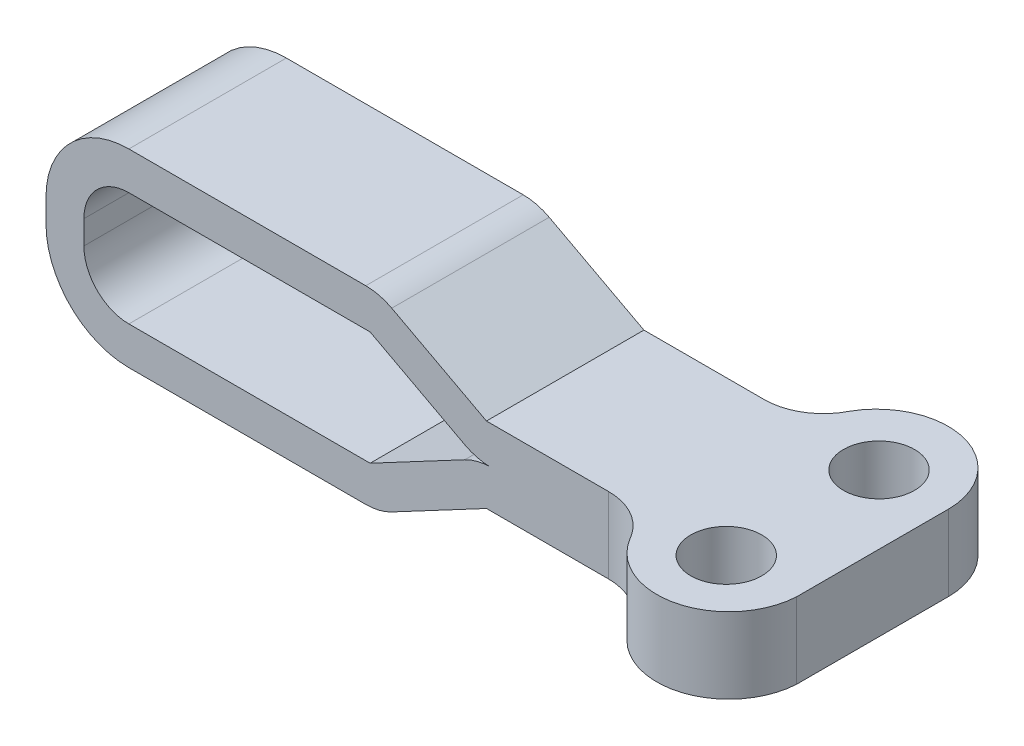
ISO-10303-21;
HEADER;
FILE_DESCRIPTION(('STEP AP214'),'2;1');
FILE_NAME('part.step','',(''),(''),'','','');
FILE_SCHEMA(('AUTOMOTIVE_DESIGN { 1 0 10303 214 1 1 1 1 }'));
ENDSEC;
DATA;
#1=APPLICATION_CONTEXT('core data for automotive mechanical design processes');
#2=APPLICATION_PROTOCOL_DEFINITION('international standard','automotive_design',2000,#1);
#3=PRODUCT_CONTEXT('',#1,'mechanical');
#4=PRODUCT('Part','Part','',(#3));
#5=PRODUCT_RELATED_PRODUCT_CATEGORY('part','',(#4));
#6=PRODUCT_DEFINITION_FORMATION('','',#4);
#7=PRODUCT_DEFINITION_CONTEXT('part definition',#1,'design');
#8=PRODUCT_DEFINITION('design','',#6,#7);
#9=PRODUCT_DEFINITION_SHAPE('','',#8);
#10=(LENGTH_UNIT() NAMED_UNIT(*) SI_UNIT(.MILLI.,.METRE.));
#11=(NAMED_UNIT(*) PLANE_ANGLE_UNIT() SI_UNIT($,.RADIAN.));
#12=(NAMED_UNIT(*) SI_UNIT($,.STERADIAN.) SOLID_ANGLE_UNIT());
#13=UNCERTAINTY_MEASURE_WITH_UNIT(LENGTH_MEASURE(1.E-05),#10,'distance_accuracy_value','');
#14=(GEOMETRIC_REPRESENTATION_CONTEXT(3) GLOBAL_UNCERTAINTY_ASSIGNED_CONTEXT((#13)) GLOBAL_UNIT_ASSIGNED_CONTEXT((#10,
#11,#12)) REPRESENTATION_CONTEXT('',''));
#15=CARTESIAN_POINT('',(0.,0.,0.));
#16=DIRECTION('',(0.,0.,1.));
#17=DIRECTION('',(1.,0.,0.));
#18=AXIS2_PLACEMENT_3D('',#15,#16,#17);
#19=CARTESIAN_POINT('',(-17.6259984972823,0.,-5.43724678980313));
#20=DIRECTION('',(0.,-1.,0.));
#21=DIRECTION('',(-1.00000000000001,0.,0.));
#22=AXIS2_PLACEMENT_3D('',#19,#20,#21);
#23=CYLINDRICAL_SURFACE('',#22,2.5);
#24=DIRECTION('',(0.,-1.,0.));
#25=VECTOR('',#24,1.);
#26=CARTESIAN_POINT('',(-15.4352933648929,0.,-6.64174295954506));
#27=LINE('',#26,#25);
#28=CARTESIAN_POINT('',(-15.4352933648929,1.6,-6.64174295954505));
#29=VERTEX_POINT('',#28);
#30=CARTESIAN_POINT('',(-15.4352933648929,-1.6,-6.64174295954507));
#31=VERTEX_POINT('',#30);
#32=EDGE_CURVE('E515',#29,#31,#27,.T.);
#33=ORIENTED_EDGE('',*,*,#32,.F.);
#34=CARTESIAN_POINT('',(-17.6259984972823,1.6,-5.43724678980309));
#35=DIRECTION('',(0.,-1.,0.));
#36=DIRECTION('',(-1.00000000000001,0.,0.));
#37=AXIS2_PLACEMENT_3D('',#34,#35,#36);
#38=CIRCLE('',#37,2.5);
#39=CARTESIAN_POINT('',(-17.6259984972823,1.6,-7.93724678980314));
#40=VERTEX_POINT('',#39);
#41=EDGE_CURVE('E356',#29,#40,#38,.F.);
#42=ORIENTED_EDGE('',*,*,#41,.T.);
#43=DIRECTION('',(0.,1.,0.));
#44=VECTOR('',#43,1.);
#45=CARTESIAN_POINT('',(-17.6259984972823,0.,-7.93724678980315));
#46=LINE('',#45,#44);
#47=CARTESIAN_POINT('',(-17.6259984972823,-1.6,-7.93724678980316));
#48=VERTEX_POINT('',#47);
#49=EDGE_CURVE('E379',#48,#40,#46,.T.);
#50=ORIENTED_EDGE('',*,*,#49,.F.);
#51=CARTESIAN_POINT('',(-17.6259984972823,-1.6,-5.43724678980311));
#52=DIRECTION('',(0.,-1.,0.));
#53=DIRECTION('',(-1.00000000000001,0.,0.));
#54=AXIS2_PLACEMENT_3D('',#51,#52,#53);
#55=CIRCLE('',#54,2.5);
#56=EDGE_CURVE('E264',#31,#48,#55,.F.);
#57=ORIENTED_EDGE('',*,*,#56,.F.);
#58=EDGE_LOOP('',(#33,#42,#50,#57));
#59=FACE_BOUND('',#58,.T.);
#60=ADVANCED_FACE('F17',(#59),#23,.F.);
#61=CARTESIAN_POINT('',(-41.3856749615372,-30.3883414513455,-8.08724678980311));
#62=DIRECTION('',(-1.00000000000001,0.,0.));
#63=DIRECTION('',(0.,1.,0.));
#64=AXIS2_PLACEMENT_3D('',#61,#62,#63);
#65=PLANE('',#64);
#66=DIRECTION('',(0.,0.,1.00000000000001));
#67=VECTOR('',#66,1.);
#68=CARTESIAN_POINT('',(-41.3856749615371,-0.5,-19.3102188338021));
#69=LINE('',#68,#67);
#70=CARTESIAN_POINT('',(-41.385674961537,-0.500000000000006,-7.93724678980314));
#71=VERTEX_POINT('',#70);
#72=CARTESIAN_POINT('',(-41.3856749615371,-0.499999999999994,-14.5872467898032));
#73=VERTEX_POINT('',#72);
#74=EDGE_CURVE('E195',#71,#73,#69,.F.);
#75=ORIENTED_EDGE('',*,*,#74,.F.);
#76=DIRECTION('',(0.,1.,0.));
#77=VECTOR('',#76,1.);
#78=CARTESIAN_POINT('',(-41.3856749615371,-25.5685929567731,-7.93724678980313));
#79=LINE('',#78,#77);
#80=CARTESIAN_POINT('',(-41.3856749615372,0.499999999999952,-7.93724678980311));
#81=VERTEX_POINT('',#80);
#82=EDGE_CURVE('E234',#81,#71,#79,.F.);
#83=ORIENTED_EDGE('',*,*,#82,.F.);
#84=DIRECTION('',(0.,0.,1.00000000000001));
#85=VECTOR('',#84,1.);
#86=CARTESIAN_POINT('',(-41.3856749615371,0.499999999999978,-19.3102188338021));
#87=LINE('',#86,#85);
#88=CARTESIAN_POINT('',(-41.3856749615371,0.499999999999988,-14.5872467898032));
#89=VERTEX_POINT('',#88);
#90=EDGE_CURVE('E338',#89,#81,#87,.T.);
#91=ORIENTED_EDGE('',*,*,#90,.F.);
#92=DIRECTION('',(0.,-1.,0.));
#93=VECTOR('',#92,1.);
#94=CARTESIAN_POINT('',(-41.3856749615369,-0.558341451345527,-14.5872467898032));
#95=LINE('',#94,#93);
#96=EDGE_CURVE('E247',#73,#89,#95,.F.);
#97=ORIENTED_EDGE('',*,*,#96,.F.);
#98=EDGE_LOOP('',(#75,#83,#91,#97));
#99=FACE_BOUND('',#98,.T.);
#100=ADVANCED_FACE('F442',(#99),#65,.T.);
#101=CARTESIAN_POINT('',(-37.885674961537,-0.5,-19.3102188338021));
#102=DIRECTION('',(0.,0.,1.00000000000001));
#103=DIRECTION('',(0.,1.,0.));
#104=AXIS2_PLACEMENT_3D('',#101,#102,#103);
#105=CYLINDRICAL_SURFACE('',#104,3.5);
#106=CARTESIAN_POINT('',(-37.885674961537,-0.500000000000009,-7.93724678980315));
#107=DIRECTION('',(0.,0.,1.00000000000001));
#108=DIRECTION('',(0.,1.,0.));
#109=AXIS2_PLACEMENT_3D('',#106,#107,#108);
#110=CIRCLE('',#109,3.5);
#111=CARTESIAN_POINT('',(-37.885674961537,-4.,-7.93724678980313));
#112=VERTEX_POINT('',#111);
#113=EDGE_CURVE('E233',#112,#71,#110,.F.);
#114=ORIENTED_EDGE('',*,*,#113,.T.);
#115=ORIENTED_EDGE('',*,*,#74,.T.);
#116=CARTESIAN_POINT('',(-37.885674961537,-0.500000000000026,-14.5872467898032));
#117=DIRECTION('',(0.,0.,1.00000000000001));
#118=DIRECTION('',(0.,1.,0.));
#119=AXIS2_PLACEMENT_3D('',#116,#117,#118);
#120=CIRCLE('',#119,3.5);
#121=CARTESIAN_POINT('',(-37.885674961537,-4.,-14.5872467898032));
#122=VERTEX_POINT('',#121);
#123=EDGE_CURVE('E226',#73,#122,#120,.T.);
#124=ORIENTED_EDGE('',*,*,#123,.T.);
#125=DIRECTION('',(0.,0.,1.00000000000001));
#126=VECTOR('',#125,1.);
#127=CARTESIAN_POINT('',(-37.885674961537,-4.,-8.08724678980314));
#128=LINE('',#127,#126);
#129=EDGE_CURVE('E221',#112,#122,#128,.F.);
#130=ORIENTED_EDGE('',*,*,#129,.F.);
#131=EDGE_LOOP('',(#114,#115,#124,#130));
#132=FACE_BOUND('',#131,.T.);
#133=ADVANCED_FACE('F464',(#132),#105,.T.);
#134=CARTESIAN_POINT('',(-12.2384835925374,-4.,-8.08724678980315));
#135=DIRECTION('',(0.,-1.,0.));
#136=DIRECTION('',(0.,0.,1.00000000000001));
#137=AXIS2_PLACEMENT_3D('',#134,#135,#136);
#138=PLANE('',#137);
#139=DIRECTION('',(-1.00000000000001,0.,0.));
#140=VECTOR('',#139,1.);
#141=CARTESIAN_POINT('',(-12.2384835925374,-4.,-14.5872467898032));
#142=LINE('',#141,#140);
#143=CARTESIAN_POINT('',(-27.8807661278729,-4.,-14.5872467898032));
#144=VERTEX_POINT('',#143);
#145=EDGE_CURVE('E204',#122,#144,#142,.F.);
#146=ORIENTED_EDGE('',*,*,#145,.T.);
#147=DIRECTION('',(0.,0.,1.00000000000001));
#148=VECTOR('',#147,1.);
#149=CARTESIAN_POINT('',(-27.8807661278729,-4.,-18.2863858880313));
#150=LINE('',#149,#148);
#151=CARTESIAN_POINT('',(-27.8807661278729,-4.,-7.93724678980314));
#152=VERTEX_POINT('',#151);
#153=EDGE_CURVE('E209',#152,#144,#150,.F.);
#154=ORIENTED_EDGE('',*,*,#153,.F.);
#155=DIRECTION('',(-1.00000000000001,0.,0.));
#156=VECTOR('',#155,1.);
#157=CARTESIAN_POINT('',(-12.2384835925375,-4.,-7.93724678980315));
#158=LINE('',#157,#156);
#159=EDGE_CURVE('E194',#152,#112,#158,.T.);
#160=ORIENTED_EDGE('',*,*,#159,.T.);
#161=ORIENTED_EDGE('',*,*,#129,.T.);
#162=EDGE_LOOP('',(#146,#154,#160,#161));
#163=FACE_BOUND('',#162,.T.);
#164=ADVANCED_FACE('F458',(#163),#138,.T.);
#165=CARTESIAN_POINT('',(-27.8807661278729,-1.6634,-18.2863858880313));
#166=DIRECTION('',(0.,0.,1.00000000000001));
#167=DIRECTION('',(0.,1.,0.));
#168=AXIS2_PLACEMENT_3D('',#165,#166,#167);
#169=CYLINDRICAL_SURFACE('',#168,2.3366);
#170=CARTESIAN_POINT('',(-27.8807661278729,-1.6634,-7.93724678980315));
#171=DIRECTION('',(0.,0.,1.00000000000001));
#172=DIRECTION('',(0.,1.,0.));
#173=AXIS2_PLACEMENT_3D('',#170,#171,#172);
#174=CIRCLE('',#173,2.3366);
#175=CARTESIAN_POINT('',(-26.7837988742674,-3.72649534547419,-7.93724678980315));
#176=VERTEX_POINT('',#175);
#177=EDGE_CURVE('E214',#176,#152,#174,.F.);
#178=ORIENTED_EDGE('',*,*,#177,.T.);
#179=ORIENTED_EDGE('',*,*,#153,.T.);
#180=CARTESIAN_POINT('',(-27.8807661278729,-1.6634,-14.5872467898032));
#181=DIRECTION('',(0.,0.,1.00000000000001));
#182=DIRECTION('',(0.,1.,0.));
#183=AXIS2_PLACEMENT_3D('',#180,#181,#182);
#184=CIRCLE('',#183,2.3366);
#185=CARTESIAN_POINT('',(-26.7837988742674,-3.72649534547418,-14.5872467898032));
#186=VERTEX_POINT('',#185);
#187=EDGE_CURVE('E281',#144,#186,#184,.T.);
#188=ORIENTED_EDGE('',*,*,#187,.T.);
#189=DIRECTION('',(0.,0.,-1.00000000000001));
#190=VECTOR('',#189,1.);
#191=CARTESIAN_POINT('',(-26.7837988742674,-3.72649534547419,-8.08724678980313));
#192=LINE('',#191,#190);
#193=EDGE_CURVE('E493',#176,#186,#192,.T.);
#194=ORIENTED_EDGE('',*,*,#193,.F.);
#195=EDGE_LOOP('',(#178,#179,#188,#194));
#196=FACE_BOUND('',#195,.T.);
#197=ADVANCED_FACE('F452',(#196),#169,.T.);
#198=CARTESIAN_POINT('',(-13.6355100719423,3.26457382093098,-8.08724678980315));
#199=DIRECTION('',(0.469471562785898,-0.882947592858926,0.));
#200=DIRECTION('',(-0.882947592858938,-0.469471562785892,0.));
#201=AXIS2_PLACEMENT_3D('',#198,#199,#200);
#202=PLANE('',#201);
#203=DIRECTION('',(-0.882947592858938,-0.469471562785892,0.));
#204=VECTOR('',#203,1.);
#205=CARTESIAN_POINT('',(-13.6355100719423,3.26457382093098,-14.5872467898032));
#206=LINE('',#205,#204);
#207=CARTESIAN_POINT('',(-22.784442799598,-1.6,-14.5872467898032));
#208=VERTEX_POINT('',#207);
#209=EDGE_CURVE('E275',#186,#208,#206,.F.);
#210=ORIENTED_EDGE('',*,*,#209,.T.);
#211=DIRECTION('',(0.,0.,1.));
#212=VECTOR('',#211,1.);
#213=CARTESIAN_POINT('',(-22.784442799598,-1.6,-8.08724678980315));
#214=LINE('',#213,#212);
#215=CARTESIAN_POINT('',(-22.784442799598,-1.6,-7.93724678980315));
#216=VERTEX_POINT('',#215);
#217=EDGE_CURVE('E376',#208,#216,#214,.T.);
#218=ORIENTED_EDGE('',*,*,#217,.T.);
#219=DIRECTION('',(-0.882947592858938,-0.469471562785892,0.));
#220=VECTOR('',#219,1.);
#221=CARTESIAN_POINT('',(-13.6355100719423,3.26457382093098,-7.93724678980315));
#222=LINE('',#221,#220);
#223=EDGE_CURVE('E278',#216,#176,#222,.T.);
#224=ORIENTED_EDGE('',*,*,#223,.T.);
#225=ORIENTED_EDGE('',*,*,#193,.T.);
#226=EDGE_LOOP('',(#210,#218,#224,#225));
#227=FACE_BOUND('',#226,.T.);
#228=ADVANCED_FACE('F449',(#227),#202,.T.);
#229=CARTESIAN_POINT('',(-22.6007877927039,-2.3366,-18.1431179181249));
#230=DIRECTION('',(0.,0.,1.00000000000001));
#231=DIRECTION('',(-1.00000000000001,0.,0.));
#232=AXIS2_PLACEMENT_3D('',#229,#230,#231);
#233=CYLINDRICAL_SURFACE('',#232,2.3366);
#234=CARTESIAN_POINT('',(-22.6007877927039,-2.3366,-7.93724678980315));
#235=DIRECTION('',(0.,0.,1.00000000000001));
#236=DIRECTION('',(-1.00000000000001,0.,0.));
#237=AXIS2_PLACEMENT_3D('',#234,#235,#236);
#238=CIRCLE('',#237,2.3366);
#239=CARTESIAN_POINT('',(-22.6007877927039,0.,-7.93724678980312));
#240=VERTEX_POINT('',#239);
#241=CARTESIAN_POINT('',(-23.6977550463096,-0.273504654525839,-7.93724678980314));
#242=VERTEX_POINT('',#241);
#243=EDGE_CURVE('E211',#240,#242,#238,.T.);
#244=ORIENTED_EDGE('',*,*,#243,.F.);
#245=DIRECTION('',(0.,0.,-1.00000000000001));
#246=VECTOR('',#245,1.);
#247=CARTESIAN_POINT('',(-22.6007877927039,0.,-8.08724678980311));
#248=LINE('',#247,#246);
#249=CARTESIAN_POINT('',(-22.6007877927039,0.,-14.5872467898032));
#250=VERTEX_POINT('',#249);
#251=EDGE_CURVE('E274',#240,#250,#248,.T.);
#252=ORIENTED_EDGE('',*,*,#251,.T.);
#253=CARTESIAN_POINT('',(-22.6007877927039,-2.3366,-14.5872467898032));
#254=DIRECTION('',(0.,0.,1.00000000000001));
#255=DIRECTION('',(-1.00000000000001,0.,0.));
#256=AXIS2_PLACEMENT_3D('',#253,#254,#255);
#257=CIRCLE('',#256,2.3366);
#258=CARTESIAN_POINT('',(-23.6977550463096,-0.273504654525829,-14.5872467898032));
#259=VERTEX_POINT('',#258);
#260=EDGE_CURVE('E272',#259,#250,#257,.F.);
#261=ORIENTED_EDGE('',*,*,#260,.F.);
#262=DIRECTION('',(0.,0.,1.00000000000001));
#263=VECTOR('',#262,1.);
#264=CARTESIAN_POINT('',(-23.6977550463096,-0.273504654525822,-18.1431179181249));
#265=LINE('',#264,#263);
#266=EDGE_CURVE('E208',#259,#242,#265,.T.);
#267=ORIENTED_EDGE('',*,*,#266,.T.);
#268=EDGE_LOOP('',(#244,#252,#261,#267));
#269=FACE_BOUND('',#268,.T.);
#270=ADVANCED_FACE('F401',(#269),#233,.T.);
#271=CARTESIAN_POINT('',(-14.3866645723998,4.67728996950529,-8.0872467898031));
#272=DIRECTION('',(0.469471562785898,-0.882947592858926,0.));
#273=DIRECTION('',(-0.882947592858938,-0.469471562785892,0.));
#274=AXIS2_PLACEMENT_3D('',#271,#272,#273);
#275=PLANE('',#274);
#276=DIRECTION('',(-0.882947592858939,-0.469471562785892,0.));
#277=VECTOR('',#276,1.);
#278=CARTESIAN_POINT('',(-23.6977550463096,-0.273504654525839,-7.93724678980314));
#279=LINE('',#278,#277);
#280=CARTESIAN_POINT('',(-27.6971111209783,-2.4,-7.93724678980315));
#281=VERTEX_POINT('',#280);
#282=EDGE_CURVE('E203',#242,#281,#279,.T.);
#283=ORIENTED_EDGE('',*,*,#282,.F.);
#284=ORIENTED_EDGE('',*,*,#266,.F.);
#285=DIRECTION('',(0.882947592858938,0.469471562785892,0.));
#286=VECTOR('',#285,1.);
#287=CARTESIAN_POINT('',(-27.5349533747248,-2.3137791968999,-14.5872467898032));
#288=LINE('',#287,#286);
#289=CARTESIAN_POINT('',(-27.6971111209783,-2.4,-14.5872467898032));
#290=VERTEX_POINT('',#289);
#291=EDGE_CURVE('E188',#290,#259,#288,.T.);
#292=ORIENTED_EDGE('',*,*,#291,.F.);
#293=DIRECTION('',(0.,0.,-1.));
#294=VECTOR('',#293,1.);
#295=CARTESIAN_POINT('',(-27.6971111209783,-2.4,-8.0872467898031));
#296=LINE('',#295,#294);
#297=EDGE_CURVE('E21',#281,#290,#296,.T.);
#298=ORIENTED_EDGE('',*,*,#297,.F.);
#299=EDGE_LOOP('',(#283,#284,#292,#298));
#300=FACE_BOUND('',#299,.T.);
#301=ADVANCED_FACE('F206',(#300),#275,.F.);
#302=CARTESIAN_POINT('',(-12.2384835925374,-2.4,-8.08724678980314));
#303=DIRECTION('',(0.,-1.,0.));
#304=DIRECTION('',(0.,0.,1.00000000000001));
#305=AXIS2_PLACEMENT_3D('',#302,#303,#304);
#306=PLANE('',#305);
#307=DIRECTION('',(-1.00000000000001,0.,0.));
#308=VECTOR('',#307,1.);
#309=CARTESIAN_POINT('',(-17.0582320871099,-2.4,-7.93724678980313));
#310=LINE('',#309,#308);
#311=CARTESIAN_POINT('',(-37.8856749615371,-2.4,-7.93724678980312));
#312=VERTEX_POINT('',#311);
#313=EDGE_CURVE('E201',#281,#312,#310,.T.);
#314=ORIENTED_EDGE('',*,*,#313,.F.);
#315=ORIENTED_EDGE('',*,*,#297,.T.);
#316=DIRECTION('',(-1.00000000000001,0.,0.));
#317=VECTOR('',#316,1.);
#318=CARTESIAN_POINT('',(-42.0684835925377,-2.4,-14.5872467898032));
#319=LINE('',#318,#317);
#320=CARTESIAN_POINT('',(-37.885674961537,-2.40000000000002,-14.5872467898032));
#321=VERTEX_POINT('',#320);
#322=EDGE_CURVE('E182',#321,#290,#319,.F.);
#323=ORIENTED_EDGE('',*,*,#322,.F.);
#324=DIRECTION('',(0.,0.,1.00000000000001));
#325=VECTOR('',#324,1.);
#326=CARTESIAN_POINT('',(-37.8856749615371,-2.4,-8.08724678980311));
#327=LINE('',#326,#325);
#328=EDGE_CURVE('E227',#312,#321,#327,.F.);
#329=ORIENTED_EDGE('',*,*,#328,.F.);
#330=EDGE_LOOP('',(#314,#315,#323,#329));
#331=FACE_BOUND('',#330,.T.);
#332=ADVANCED_FACE('F199',(#331),#306,.F.);
#333=CARTESIAN_POINT('',(-37.885674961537,-0.5,-19.3102188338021));
#334=DIRECTION('',(0.,0.,1.00000000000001));
#335=DIRECTION('',(0.,1.,0.));
#336=AXIS2_PLACEMENT_3D('',#333,#334,#335);
#337=CYLINDRICAL_SURFACE('',#336,1.9);
#338=DIRECTION('',(0.,0.,1.00000000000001));
#339=VECTOR('',#338,1.);
#340=CARTESIAN_POINT('',(-39.785674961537,-0.500000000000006,-19.310218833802));
#341=LINE('',#340,#339);
#342=CARTESIAN_POINT('',(-39.785674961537,-0.500000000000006,-7.93724678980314));
#343=VERTEX_POINT('',#342);
#344=CARTESIAN_POINT('',(-39.785674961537,-0.50000000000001,-14.5872467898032));
#345=VERTEX_POINT('',#344);
#346=EDGE_CURVE('E236',#343,#345,#341,.F.);
#347=ORIENTED_EDGE('',*,*,#346,.F.);
#348=CARTESIAN_POINT('',(-37.885674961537,-0.500000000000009,-7.93724678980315));
#349=DIRECTION('',(0.,0.,1.00000000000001));
#350=DIRECTION('',(0.,1.,0.));
#351=AXIS2_PLACEMENT_3D('',#348,#349,#350);
#352=CIRCLE('',#351,1.9);
#353=EDGE_CURVE('E230',#343,#312,#352,.T.);
#354=ORIENTED_EDGE('',*,*,#353,.T.);
#355=ORIENTED_EDGE('',*,*,#328,.T.);
#356=CARTESIAN_POINT('',(-37.885674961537,-0.500000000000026,-14.5872467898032));
#357=DIRECTION('',(0.,0.,1.00000000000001));
#358=DIRECTION('',(0.,1.,0.));
#359=AXIS2_PLACEMENT_3D('',#356,#357,#358);
#360=CIRCLE('',#359,1.9);
#361=EDGE_CURVE('E190',#321,#345,#360,.F.);
#362=ORIENTED_EDGE('',*,*,#361,.T.);
#363=EDGE_LOOP('',(#347,#354,#355,#362));
#364=FACE_BOUND('',#363,.T.);
#365=ADVANCED_FACE('F410',(#364),#337,.F.);
#366=CARTESIAN_POINT('',(-39.7856749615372,-30.3883414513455,-8.08724678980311));
#367=DIRECTION('',(-1.00000000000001,0.,0.));
#368=DIRECTION('',(0.,1.,0.));
#369=AXIS2_PLACEMENT_3D('',#366,#367,#368);
#370=PLANE('',#369);
#371=ORIENTED_EDGE('',*,*,#346,.T.);
#372=DIRECTION('',(0.,-1.,0.));
#373=VECTOR('',#372,1.);
#374=CARTESIAN_POINT('',(-39.785674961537,-0.558341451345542,-14.5872467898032));
#375=LINE('',#374,#373);
#376=CARTESIAN_POINT('',(-39.7856749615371,0.499999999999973,-14.5872467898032));
#377=VERTEX_POINT('',#376);
#378=EDGE_CURVE('E241',#377,#345,#375,.T.);
#379=ORIENTED_EDGE('',*,*,#378,.F.);
#380=DIRECTION('',(0.,0.,1.00000000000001));
#381=VECTOR('',#380,1.);
#382=CARTESIAN_POINT('',(-39.7856749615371,0.49999999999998,-19.3102188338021));
#383=LINE('',#382,#381);
#384=CARTESIAN_POINT('',(-39.7856749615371,0.499999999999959,-7.93724678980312));
#385=VERTEX_POINT('',#384);
#386=EDGE_CURVE('E347',#377,#385,#383,.T.);
#387=ORIENTED_EDGE('',*,*,#386,.T.);
#388=DIRECTION('',(0.,1.,0.));
#389=VECTOR('',#388,1.);
#390=CARTESIAN_POINT('',(-39.7856749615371,-25.5685929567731,-7.93724678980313));
#391=LINE('',#390,#389);
#392=EDGE_CURVE('E237',#343,#385,#391,.T.);
#393=ORIENTED_EDGE('',*,*,#392,.F.);
#394=EDGE_LOOP('',(#371,#379,#387,#393));
#395=FACE_BOUND('',#394,.T.);
#396=ADVANCED_FACE('F406',(#395),#370,.F.);
#397=CARTESIAN_POINT('',(-42.6362500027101,0.,-14.5872467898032));
#398=DIRECTION('',(0.,0.,-1.00000000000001));
#399=DIRECTION('',(0.,-1.,0.));
#400=AXIS2_PLACEMENT_3D('',#397,#398,#399);
#401=PLANE('',#400);
#402=ORIENTED_EDGE('',*,*,#96,.T.);
#403=CARTESIAN_POINT('',(-37.885674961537,0.500000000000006,-14.5872467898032));
#404=DIRECTION('',(0.,0.,1.00000000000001));
#405=DIRECTION('',(0.,1.,0.));
#406=AXIS2_PLACEMENT_3D('',#403,#404,#405);
#407=CIRCLE('',#406,3.5);
#408=CARTESIAN_POINT('',(-37.885674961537,4.,-14.5872467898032));
#409=VERTEX_POINT('',#408);
#410=EDGE_CURVE('E342',#409,#89,#407,.T.);
#411=ORIENTED_EDGE('',*,*,#410,.F.);
#412=DIRECTION('',(-1.00000000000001,0.,0.));
#413=VECTOR('',#412,1.);
#414=CARTESIAN_POINT('',(-12.2384835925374,4.,-14.5872467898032));
#415=LINE('',#414,#413);
#416=CARTESIAN_POINT('',(-27.8807661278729,4.,-14.5872467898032));
#417=VERTEX_POINT('',#416);
#418=EDGE_CURVE('E326',#409,#417,#415,.F.);
#419=ORIENTED_EDGE('',*,*,#418,.T.);
#420=CARTESIAN_POINT('',(-27.8807661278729,1.6634,-14.5872467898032));
#421=DIRECTION('',(0.,0.,1.00000000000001));
#422=DIRECTION('',(0.,1.,0.));
#423=AXIS2_PLACEMENT_3D('',#420,#421,#422);
#424=CIRCLE('',#423,2.3366);
#425=CARTESIAN_POINT('',(-26.7837988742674,3.72649534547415,-14.5872467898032));
#426=VERTEX_POINT('',#425);
#427=EDGE_CURVE('E317',#426,#417,#424,.T.);
#428=ORIENTED_EDGE('',*,*,#427,.F.);
#429=DIRECTION('',(-0.882947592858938,0.469471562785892,0.));
#430=VECTOR('',#429,1.);
#431=CARTESIAN_POINT('',(-13.6355100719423,-3.26457382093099,-14.5872467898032));
#432=LINE('',#431,#430);
#433=CARTESIAN_POINT('',(-22.7844427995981,1.6,-14.5872467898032));
#434=VERTEX_POINT('',#433);
#435=EDGE_CURVE('E301',#426,#434,#432,.F.);
#436=ORIENTED_EDGE('',*,*,#435,.T.);
#437=DIRECTION('',(-1.00000000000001,0.,0.));
#438=VECTOR('',#437,1.);
#439=CARTESIAN_POINT('',(-12.8062500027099,1.6,-14.5872467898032));
#440=LINE('',#439,#438);
#441=CARTESIAN_POINT('',(-17.7077129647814,1.6,-14.5872467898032));
#442=VERTEX_POINT('',#441);
#443=EDGE_CURVE('E293',#434,#442,#440,.F.);
#444=ORIENTED_EDGE('',*,*,#443,.T.);
#445=DIRECTION('',(0.,-1.,0.));
#446=VECTOR('',#445,1.);
#447=CARTESIAN_POINT('',(-17.7077129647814,0.,-14.5872467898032));
#448=LINE('',#447,#446);
#449=CARTESIAN_POINT('',(-17.7077129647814,-1.6,-14.5872467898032));
#450=VERTEX_POINT('',#449);
#451=EDGE_CURVE('E378',#442,#450,#448,.T.);
#452=ORIENTED_EDGE('',*,*,#451,.T.);
#453=DIRECTION('',(-1.00000000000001,0.,0.));
#454=VECTOR('',#453,1.);
#455=CARTESIAN_POINT('',(-12.8062500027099,-1.6,-14.5872467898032));
#456=LINE('',#455,#454);
#457=EDGE_CURVE('E263',#208,#450,#456,.F.);
#458=ORIENTED_EDGE('',*,*,#457,.F.);
#459=ORIENTED_EDGE('',*,*,#209,.F.);
#460=ORIENTED_EDGE('',*,*,#187,.F.);
#461=ORIENTED_EDGE('',*,*,#145,.F.);
#462=ORIENTED_EDGE('',*,*,#123,.F.);
#463=EDGE_LOOP('',(#402,#411,#419,#428,#436,#444,#452,#458,#459,#460,#461,#462));
#464=FACE_BOUND('',#463,.T.);
#465=CARTESIAN_POINT('',(-37.885674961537,0.500000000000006,-14.5872467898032));
#466=DIRECTION('',(0.,0.,1.00000000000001));
#467=DIRECTION('',(0.,1.,0.));
#468=AXIS2_PLACEMENT_3D('',#465,#466,#467);
#469=CIRCLE('',#468,1.9);
#470=CARTESIAN_POINT('',(-37.885674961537,2.4,-14.5872467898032));
#471=VERTEX_POINT('',#470);
#472=EDGE_CURVE('E350',#471,#377,#469,.T.);
#473=ORIENTED_EDGE('',*,*,#472,.T.);
#474=ORIENTED_EDGE('',*,*,#378,.T.);
#475=ORIENTED_EDGE('',*,*,#361,.F.);
#476=ORIENTED_EDGE('',*,*,#322,.T.);
#477=ORIENTED_EDGE('',*,*,#291,.T.);
#478=ORIENTED_EDGE('',*,*,#260,.T.);
#479=CARTESIAN_POINT('',(-22.6007877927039,2.3366,-14.5872467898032));
#480=DIRECTION('',(0.,0.,1.00000000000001));
#481=DIRECTION('',(-1.00000000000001,0.,0.));
#482=AXIS2_PLACEMENT_3D('',#479,#480,#481);
#483=CIRCLE('',#482,2.3366);
#484=CARTESIAN_POINT('',(-23.6977550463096,0.273504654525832,-14.5872467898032));
#485=VERTEX_POINT('',#484);
#486=EDGE_CURVE('E300',#485,#250,#483,.T.);
#487=ORIENTED_EDGE('',*,*,#486,.F.);
#488=DIRECTION('',(-0.882947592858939,0.469471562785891,0.));
#489=VECTOR('',#488,1.);
#490=CARTESIAN_POINT('',(-23.6977550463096,0.273504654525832,-14.5872467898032));
#491=LINE('',#490,#489);
#492=CARTESIAN_POINT('',(-27.6971111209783,2.4,-14.5872467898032));
#493=VERTEX_POINT('',#492);
#494=EDGE_CURVE('E318',#485,#493,#491,.T.);
#495=ORIENTED_EDGE('',*,*,#494,.T.);
#496=DIRECTION('',(-1.00000000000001,0.,0.));
#497=VECTOR('',#496,1.);
#498=CARTESIAN_POINT('',(-42.0684835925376,2.4,-14.5872467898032));
#499=LINE('',#498,#497);
#500=EDGE_CURVE('E333',#493,#471,#499,.T.);
#501=ORIENTED_EDGE('',*,*,#500,.T.);
#502=EDGE_LOOP('',(#473,#474,#475,#476,#477,#478,#487,#495,#501));
#503=FACE_BOUND('',#502,.T.);
#504=ADVANCED_FACE('F185',(#464,#503),#401,.T.);
#505=CARTESIAN_POINT('',(-17.7077129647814,0.,-17.0872467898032));
#506=DIRECTION('',(0.,-1.,0.));
#507=DIRECTION('',(-1.00000000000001,0.,0.));
#508=AXIS2_PLACEMENT_3D('',#505,#506,#507);
#509=CYLINDRICAL_SURFACE('',#508,2.5);
#510=ORIENTED_EDGE('',*,*,#451,.F.);
#511=CARTESIAN_POINT('',(-17.7077129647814,1.6,-17.0872467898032));
#512=DIRECTION('',(0.,-1.,0.));
#513=DIRECTION('',(-1.00000000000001,0.,0.));
#514=AXIS2_PLACEMENT_3D('',#511,#512,#513);
#515=CIRCLE('',#514,2.5);
#516=CARTESIAN_POINT('',(-15.4788394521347,1.6,-15.9549381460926));
#517=VERTEX_POINT('',#516);
#518=EDGE_CURVE('E296',#442,#517,#515,.F.);
#519=ORIENTED_EDGE('',*,*,#518,.T.);
#520=DIRECTION('',(0.,-1.,0.));
#521=VECTOR('',#520,1.);
#522=CARTESIAN_POINT('',(-15.4788394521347,8.4,-15.9549381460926));
#523=LINE('',#522,#521);
#524=CARTESIAN_POINT('',(-15.4788394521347,-1.6,-15.9549381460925));
#525=VERTEX_POINT('',#524);
#526=EDGE_CURVE('E509',#525,#517,#523,.F.);
#527=ORIENTED_EDGE('',*,*,#526,.F.);
#528=CARTESIAN_POINT('',(-17.7077129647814,-1.6,-17.0872467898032));
#529=DIRECTION('',(0.,-1.,0.));
#530=DIRECTION('',(-1.00000000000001,0.,0.));
#531=AXIS2_PLACEMENT_3D('',#528,#529,#530);
#532=CIRCLE('',#531,2.5);
#533=EDGE_CURVE('E260',#450,#525,#532,.F.);
#534=ORIENTED_EDGE('',*,*,#533,.F.);
#535=EDGE_LOOP('',(#510,#519,#527,#534));
#536=FACE_BOUND('',#535,.T.);
#537=ADVANCED_FACE('F535',(#536),#509,.F.);
#538=CARTESIAN_POINT('',(-12.838380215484,8.4,-14.4643403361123));
#539=DIRECTION('',(0.,-1.,0.));
#540=DIRECTION('',(-1.00000000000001,0.,0.));
#541=AXIS2_PLACEMENT_3D('',#538,#539,#540);
#542=CYLINDRICAL_SURFACE('',#541,3.03214557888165);
#543=ORIENTED_EDGE('',*,*,#526,.T.);
#544=CARTESIAN_POINT('',(-12.8383802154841,1.6,-14.4643403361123));
#545=DIRECTION('',(0.,1.,0.));
#546=DIRECTION('',(1.00000000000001,0.,0.));
#547=AXIS2_PLACEMENT_3D('',#544,#545,#546);
#548=CIRCLE('',#547,3.03214557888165);
#549=CARTESIAN_POINT('',(-9.8062500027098,1.6,-14.473993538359));
#550=VERTEX_POINT('',#549);
#551=EDGE_CURVE('E292',#517,#550,#548,.F.);
#552=ORIENTED_EDGE('',*,*,#551,.T.);
#553=DIRECTION('',(0.,-1.,0.));
#554=VECTOR('',#553,1.);
#555=CARTESIAN_POINT('',(-9.8062500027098,0.,-14.4739935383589));
#556=LINE('',#555,#554);
#557=CARTESIAN_POINT('',(-9.80625000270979,-1.6,-14.473993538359));
#558=VERTEX_POINT('',#557);
#559=EDGE_CURVE('E36',#558,#550,#556,.F.);
#560=ORIENTED_EDGE('',*,*,#559,.F.);
#561=CARTESIAN_POINT('',(-12.838380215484,-1.6,-14.4643403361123));
#562=DIRECTION('',(0.,-1.,0.));
#563=DIRECTION('',(-1.00000000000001,0.,0.));
#564=AXIS2_PLACEMENT_3D('',#561,#562,#563);
#565=CIRCLE('',#564,3.03214557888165);
#566=EDGE_CURVE('E257',#525,#558,#565,.T.);
#567=ORIENTED_EDGE('',*,*,#566,.F.);
#568=EDGE_LOOP('',(#543,#552,#560,#567));
#569=FACE_BOUND('',#568,.T.);
#570=ADVANCED_FACE('F537',(#569),#542,.T.);
#571=CARTESIAN_POINT('',(-12.8062500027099,-1.6,-8.08724678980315));
#572=DIRECTION('',(0.,-1.,0.));
#573=DIRECTION('',(-1.00000000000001,0.,0.));
#574=AXIS2_PLACEMENT_3D('',#571,#572,#573);
#575=PLANE('',#574);
#576=CARTESIAN_POINT('',(-12.8062500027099,-1.6,-8.08724678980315));
#577=DIRECTION('',(0.,-1.,0.));
#578=DIRECTION('',(-1.00000000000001,0.,0.));
#579=AXIS2_PLACEMENT_3D('',#576,#577,#578);
#580=CIRCLE('',#579,1.5);
#581=CARTESIAN_POINT('',(-14.3062500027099,-1.6,-8.08724678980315));
#582=VERTEX_POINT('',#581);
#583=EDGE_CURVE('E11',#582,#582,#580,.F.);
#584=ORIENTED_EDGE('',*,*,#583,.T.);
#585=EDGE_LOOP('',(#584));
#586=FACE_BOUND('',#585,.T.);
#587=CARTESIAN_POINT('',(-12.7062500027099,-1.6,-14.4372467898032));
#588=DIRECTION('',(0.,-1.,0.));
#589=DIRECTION('',(-1.00000000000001,0.,0.));
#590=AXIS2_PLACEMENT_3D('',#587,#588,#589);
#591=CIRCLE('',#590,1.5);
#592=CARTESIAN_POINT('',(-14.2062500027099,-1.6,-14.4372467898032));
#593=VERTEX_POINT('',#592);
#594=EDGE_CURVE('E27',#593,#593,#591,.F.);
#595=ORIENTED_EDGE('',*,*,#594,.T.);
#596=EDGE_LOOP('',(#595));
#597=FACE_BOUND('',#596,.T.);
#598=ORIENTED_EDGE('',*,*,#566,.T.);
#599=DIRECTION('',(0.,0.,-1.00000000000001));
#600=VECTOR('',#599,1.);
#601=CARTESIAN_POINT('',(-9.80625000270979,-1.6,-8.08724678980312));
#602=LINE('',#601,#600);
#603=CARTESIAN_POINT('',(-9.80625000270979,-1.6,-8.0505000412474));
#604=VERTEX_POINT('',#603);
#605=EDGE_CURVE('E256',#558,#604,#602,.F.);
#606=ORIENTED_EDGE('',*,*,#605,.T.);
#607=CARTESIAN_POINT('',(-12.8411980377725,-1.6,-8.22689045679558));
#608=DIRECTION('',(0.,-1.,0.));
#609=DIRECTION('',(-1.00000000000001,0.,0.));
#610=AXIS2_PLACEMENT_3D('',#607,#608,#609);
#611=CIRCLE('',#610,3.04006959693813);
#612=EDGE_CURVE('E268',#604,#31,#611,.T.);
#613=ORIENTED_EDGE('',*,*,#612,.T.);
#614=ORIENTED_EDGE('',*,*,#56,.T.);
#615=DIRECTION('',(-1.00000000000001,0.,0.));
#616=VECTOR('',#615,1.);
#617=CARTESIAN_POINT('',(-12.8062500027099,-1.6,-7.93724678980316));
#618=LINE('',#617,#616);
#619=EDGE_CURVE('E267',#48,#216,#618,.T.);
#620=ORIENTED_EDGE('',*,*,#619,.T.);
#621=ORIENTED_EDGE('',*,*,#217,.F.);
#622=ORIENTED_EDGE('',*,*,#457,.T.);
#623=ORIENTED_EDGE('',*,*,#533,.T.);
#624=EDGE_LOOP('',(#598,#606,#613,#614,#620,#621,#622,#623));
#625=FACE_BOUND('',#624,.T.);
#626=ADVANCED_FACE('F502',(#586,#597,#625),#575,.T.);
#627=CARTESIAN_POINT('',(-12.8062500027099,0.,-8.08724678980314));
#628=DIRECTION('',(0.,-1.,0.));
#629=DIRECTION('',(-1.00000000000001,0.,0.));
#630=AXIS2_PLACEMENT_3D('',#627,#628,#629);
#631=CYLINDRICAL_SURFACE('',#630,1.5);
#632=ORIENTED_EDGE('',*,*,#583,.F.);
#633=EDGE_LOOP('',(#632));
#634=FACE_BOUND('',#633,.T.);
#635=CARTESIAN_POINT('',(-12.8062500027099,1.6,-8.08724678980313));
#636=DIRECTION('',(0.,-1.,0.));
#637=DIRECTION('',(-1.00000000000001,0.,0.));
#638=AXIS2_PLACEMENT_3D('',#635,#636,#637);
#639=CIRCLE('',#638,1.5);
#640=CARTESIAN_POINT('',(-14.3062500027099,1.6,-8.08724678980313));
#641=VERTEX_POINT('',#640);
#642=EDGE_CURVE('E353',#641,#641,#639,.F.);
#643=ORIENTED_EDGE('',*,*,#642,.T.);
#644=EDGE_LOOP('',(#643));
#645=FACE_BOUND('',#644,.T.);
#646=ADVANCED_FACE('F545',(#634,#645),#631,.F.);
#647=CARTESIAN_POINT('',(-12.7062500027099,0.,-14.4372467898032));
#648=DIRECTION('',(0.,-1.,0.));
#649=DIRECTION('',(-1.00000000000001,0.,0.));
#650=AXIS2_PLACEMENT_3D('',#647,#648,#649);
#651=CYLINDRICAL_SURFACE('',#650,1.5);
#652=ORIENTED_EDGE('',*,*,#594,.F.);
#653=EDGE_LOOP('',(#652));
#654=FACE_BOUND('',#653,.T.);
#655=CARTESIAN_POINT('',(-12.7062500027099,1.6,-14.4372467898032));
#656=DIRECTION('',(0.,-1.,0.));
#657=DIRECTION('',(-1.00000000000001,0.,0.));
#658=AXIS2_PLACEMENT_3D('',#655,#656,#657);
#659=CIRCLE('',#658,1.5);
#660=CARTESIAN_POINT('',(-14.2062500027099,1.6,-14.4372467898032));
#661=VERTEX_POINT('',#660);
#662=EDGE_CURVE('E251',#661,#661,#659,.F.);
#663=ORIENTED_EDGE('',*,*,#662,.T.);
#664=EDGE_LOOP('',(#663));
#665=FACE_BOUND('',#664,.T.);
#666=ADVANCED_FACE('F447',(#654,#665),#651,.F.);
#667=CARTESIAN_POINT('',(-12.8411980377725,8.4,-8.22689045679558));
#668=DIRECTION('',(0.,-1.,0.));
#669=DIRECTION('',(-1.00000000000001,0.,0.));
#670=AXIS2_PLACEMENT_3D('',#667,#668,#669);
#671=CYLINDRICAL_SURFACE('',#670,3.04006959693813);
#672=DIRECTION('',(0.,-1.,0.));
#673=VECTOR('',#672,1.);
#674=CARTESIAN_POINT('',(-9.80625000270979,0.,-8.05050004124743));
#675=LINE('',#674,#673);
#676=CARTESIAN_POINT('',(-9.8062500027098,1.6,-8.05050004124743));
#677=VERTEX_POINT('',#676);
#678=EDGE_CURVE('E271',#677,#604,#675,.T.);
#679=ORIENTED_EDGE('',*,*,#678,.F.);
#680=CARTESIAN_POINT('',(-12.8411980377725,1.60000000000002,-8.22689045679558));
#681=DIRECTION('',(0.,1.,0.));
#682=DIRECTION('',(1.00000000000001,0.,0.));
#683=AXIS2_PLACEMENT_3D('',#680,#681,#682);
#684=CIRCLE('',#683,3.04006959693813);
#685=EDGE_CURVE('E291',#677,#29,#684,.F.);
#686=ORIENTED_EDGE('',*,*,#685,.T.);
#687=ORIENTED_EDGE('',*,*,#32,.T.);
#688=ORIENTED_EDGE('',*,*,#612,.F.);
#689=EDGE_LOOP('',(#679,#686,#687,#688));
#690=FACE_BOUND('',#689,.T.);
#691=ADVANCED_FACE('F434',(#690),#671,.T.);
#692=CARTESIAN_POINT('',(-9.8062500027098,0.,-14.4739935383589));
#693=DIRECTION('',(1.00000000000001,0.,0.));
#694=DIRECTION('',(0.,-1.,0.));
#695=AXIS2_PLACEMENT_3D('',#692,#693,#694);
#696=PLANE('',#695);
#697=ORIENTED_EDGE('',*,*,#559,.T.);
#698=DIRECTION('',(0.,0.,-1.00000000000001));
#699=VECTOR('',#698,1.);
#700=CARTESIAN_POINT('',(-9.8062500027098,1.6,-8.08724678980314));
#701=LINE('',#700,#699);
#702=EDGE_CURVE('E288',#550,#677,#701,.F.);
#703=ORIENTED_EDGE('',*,*,#702,.T.);
#704=ORIENTED_EDGE('',*,*,#678,.T.);
#705=ORIENTED_EDGE('',*,*,#605,.F.);
#706=EDGE_LOOP('',(#697,#703,#704,#705));
#707=FACE_BOUND('',#706,.T.);
#708=ADVANCED_FACE('F428',(#707),#696,.T.);
#709=CARTESIAN_POINT('',(-17.6259984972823,0.,-7.93724678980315));
#710=DIRECTION('',(0.,0.,1.00000000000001));
#711=DIRECTION('',(0.,1.,0.));
#712=AXIS2_PLACEMENT_3D('',#709,#710,#711);
#713=PLANE('',#712);
#714=ORIENTED_EDGE('',*,*,#392,.T.);
#715=CARTESIAN_POINT('',(-37.8856749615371,0.499999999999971,-7.93724678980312));
#716=DIRECTION('',(0.,0.,1.00000000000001));
#717=DIRECTION('',(0.,1.,0.));
#718=AXIS2_PLACEMENT_3D('',#715,#716,#717);
#719=CIRCLE('',#718,1.9);
#720=CARTESIAN_POINT('',(-37.885674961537,2.39999999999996,-7.93724678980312));
#721=VERTEX_POINT('',#720);
#722=EDGE_CURVE('E346',#385,#721,#719,.F.);
#723=ORIENTED_EDGE('',*,*,#722,.T.);
#724=DIRECTION('',(-1.00000000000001,0.,0.));
#725=VECTOR('',#724,1.);
#726=CARTESIAN_POINT('',(-17.0582320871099,2.4,-7.93724678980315));
#727=LINE('',#726,#725);
#728=CARTESIAN_POINT('',(-27.6971111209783,2.4,-7.93724678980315));
#729=VERTEX_POINT('',#728);
#730=EDGE_CURVE('E336',#721,#729,#727,.F.);
#731=ORIENTED_EDGE('',*,*,#730,.T.);
#732=DIRECTION('',(0.882947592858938,-0.469471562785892,0.));
#733=VECTOR('',#732,1.);
#734=CARTESIAN_POINT('',(-27.5349533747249,2.31377919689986,-7.93724678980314));
#735=LINE('',#734,#733);
#736=CARTESIAN_POINT('',(-23.6977550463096,0.273504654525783,-7.93724678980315));
#737=VERTEX_POINT('',#736);
#738=EDGE_CURVE('E315',#729,#737,#735,.T.);
#739=ORIENTED_EDGE('',*,*,#738,.T.);
#740=CARTESIAN_POINT('',(-22.6007877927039,2.33659999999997,-7.93724678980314));
#741=DIRECTION('',(0.,0.,1.00000000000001));
#742=DIRECTION('',(-1.00000000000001,0.,0.));
#743=AXIS2_PLACEMENT_3D('',#740,#741,#742);
#744=CIRCLE('',#743,2.3366);
#745=EDGE_CURVE('E305',#240,#737,#744,.F.);
#746=ORIENTED_EDGE('',*,*,#745,.F.);
#747=ORIENTED_EDGE('',*,*,#243,.T.);
#748=ORIENTED_EDGE('',*,*,#282,.T.);
#749=ORIENTED_EDGE('',*,*,#313,.T.);
#750=ORIENTED_EDGE('',*,*,#353,.F.);
#751=EDGE_LOOP('',(#714,#723,#731,#739,#746,#747,#748,#749,#750));
#752=FACE_BOUND('',#751,.T.);
#753=CARTESIAN_POINT('',(-37.8856749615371,0.499999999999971,-7.93724678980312));
#754=DIRECTION('',(0.,0.,1.00000000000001));
#755=DIRECTION('',(0.,1.,0.));
#756=AXIS2_PLACEMENT_3D('',#753,#754,#755);
#757=CIRCLE('',#756,3.5);
#758=CARTESIAN_POINT('',(-37.885674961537,4.,-7.93724678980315));
#759=VERTEX_POINT('',#758);
#760=EDGE_CURVE('E341',#81,#759,#757,.F.);
#761=ORIENTED_EDGE('',*,*,#760,.F.);
#762=ORIENTED_EDGE('',*,*,#82,.T.);
#763=ORIENTED_EDGE('',*,*,#113,.F.);
#764=ORIENTED_EDGE('',*,*,#159,.F.);
#765=ORIENTED_EDGE('',*,*,#177,.F.);
#766=ORIENTED_EDGE('',*,*,#223,.F.);
#767=ORIENTED_EDGE('',*,*,#619,.F.);
#768=ORIENTED_EDGE('',*,*,#49,.T.);
#769=DIRECTION('',(-1.00000000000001,0.,0.));
#770=VECTOR('',#769,1.);
#771=CARTESIAN_POINT('',(-12.8062500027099,1.6,-7.93724678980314));
#772=LINE('',#771,#770);
#773=CARTESIAN_POINT('',(-22.7844427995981,1.6,-7.93724678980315));
#774=VERTEX_POINT('',#773);
#775=EDGE_CURVE('E298',#40,#774,#772,.T.);
#776=ORIENTED_EDGE('',*,*,#775,.T.);
#777=DIRECTION('',(-0.882947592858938,0.469471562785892,0.));
#778=VECTOR('',#777,1.);
#779=CARTESIAN_POINT('',(-13.6355100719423,-3.26457382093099,-7.93724678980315));
#780=LINE('',#779,#778);
#781=CARTESIAN_POINT('',(-26.7837988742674,3.72649534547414,-7.93724678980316));
#782=VERTEX_POINT('',#781);
#783=EDGE_CURVE('E304',#774,#782,#780,.T.);
#784=ORIENTED_EDGE('',*,*,#783,.T.);
#785=CARTESIAN_POINT('',(-27.8807661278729,1.66339999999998,-7.93724678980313));
#786=DIRECTION('',(0.,0.,1.00000000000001));
#787=DIRECTION('',(0.,1.,0.));
#788=AXIS2_PLACEMENT_3D('',#785,#786,#787);
#789=CIRCLE('',#788,2.3366);
#790=CARTESIAN_POINT('',(-27.8807661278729,4.,-7.93724678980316));
#791=VERTEX_POINT('',#790);
#792=EDGE_CURVE('E312',#791,#782,#789,.F.);
#793=ORIENTED_EDGE('',*,*,#792,.F.);
#794=DIRECTION('',(-1.00000000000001,0.,0.));
#795=VECTOR('',#794,1.);
#796=CARTESIAN_POINT('',(-12.2384835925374,4.,-7.93724678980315));
#797=LINE('',#796,#795);
#798=EDGE_CURVE('E322',#791,#759,#797,.T.);
#799=ORIENTED_EDGE('',*,*,#798,.T.);
#800=EDGE_LOOP('',(#761,#762,#763,#764,#765,#766,#767,#768,#776,#784,#793,#799));
#801=FACE_BOUND('',#800,.T.);
#802=ADVANCED_FACE('F389',(#752,#801),#713,.T.);
#803=CARTESIAN_POINT('',(-37.8856749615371,0.499999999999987,-19.3102188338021));
#804=DIRECTION('',(0.,0.,1.00000000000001));
#805=DIRECTION('',(0.,1.,0.));
#806=AXIS2_PLACEMENT_3D('',#803,#804,#805);
#807=CYLINDRICAL_SURFACE('',#806,1.9);
#808=DIRECTION('',(0.,0.,1.00000000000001));
#809=VECTOR('',#808,1.);
#810=CARTESIAN_POINT('',(-37.885674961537,2.4,-8.08724678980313));
#811=LINE('',#810,#809);
#812=EDGE_CURVE('E337',#721,#471,#811,.F.);
#813=ORIENTED_EDGE('',*,*,#812,.F.);
#814=ORIENTED_EDGE('',*,*,#722,.F.);
#815=ORIENTED_EDGE('',*,*,#386,.F.);
#816=ORIENTED_EDGE('',*,*,#472,.F.);
#817=EDGE_LOOP('',(#813,#814,#815,#816));
#818=FACE_BOUND('',#817,.T.);
#819=ADVANCED_FACE('F19',(#818),#807,.F.);
#820=CARTESIAN_POINT('',(-12.2384835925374,2.4,-8.08724678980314));
#821=DIRECTION('',(0.,-1.,0.));
#822=DIRECTION('',(0.,0.,1.00000000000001));
#823=AXIS2_PLACEMENT_3D('',#820,#821,#822);
#824=PLANE('',#823);
#825=ORIENTED_EDGE('',*,*,#500,.F.);
#826=DIRECTION('',(0.,0.,1.));
#827=VECTOR('',#826,1.);
#828=CARTESIAN_POINT('',(-27.6971111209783,2.4,-8.08724678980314));
#829=LINE('',#828,#827);
#830=EDGE_CURVE('E329',#493,#729,#829,.T.);
#831=ORIENTED_EDGE('',*,*,#830,.T.);
#832=ORIENTED_EDGE('',*,*,#730,.F.);
#833=ORIENTED_EDGE('',*,*,#812,.T.);
#834=EDGE_LOOP('',(#825,#831,#832,#833));
#835=FACE_BOUND('',#834,.T.);
#836=ADVANCED_FACE('F384',(#835),#824,.T.);
#837=CARTESIAN_POINT('',(-14.3866645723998,-4.67728996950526,-8.08724678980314));
#838=DIRECTION('',(-0.469471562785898,-0.882947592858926,0.));
#839=DIRECTION('',(-0.882947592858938,0.469471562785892,0.));
#840=AXIS2_PLACEMENT_3D('',#837,#838,#839);
#841=PLANE('',#840);
#842=ORIENTED_EDGE('',*,*,#494,.F.);
#843=DIRECTION('',(0.,0.,1.00000000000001));
#844=VECTOR('',#843,1.);
#845=CARTESIAN_POINT('',(-23.6977550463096,0.273504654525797,-18.1431179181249));
#846=LINE('',#845,#844);
#847=EDGE_CURVE('E309',#737,#485,#846,.F.);
#848=ORIENTED_EDGE('',*,*,#847,.F.);
#849=ORIENTED_EDGE('',*,*,#738,.F.);
#850=ORIENTED_EDGE('',*,*,#830,.F.);
#851=EDGE_LOOP('',(#842,#848,#849,#850));
#852=FACE_BOUND('',#851,.T.);
#853=ADVANCED_FACE('F395',(#852),#841,.T.);
#854=CARTESIAN_POINT('',(-22.6007877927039,2.33659999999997,-18.1431179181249));
#855=DIRECTION('',(0.,0.,1.00000000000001));
#856=DIRECTION('',(-1.00000000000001,0.,0.));
#857=AXIS2_PLACEMENT_3D('',#854,#855,#856);
#858=CYLINDRICAL_SURFACE('',#857,2.3366);
#859=ORIENTED_EDGE('',*,*,#745,.T.);
#860=ORIENTED_EDGE('',*,*,#847,.T.);
#861=ORIENTED_EDGE('',*,*,#486,.T.);
#862=ORIENTED_EDGE('',*,*,#251,.F.);
#863=EDGE_LOOP('',(#859,#860,#861,#862));
#864=FACE_BOUND('',#863,.T.);
#865=ADVANCED_FACE('F397',(#864),#858,.T.);
#866=CARTESIAN_POINT('',(-13.6355100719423,-3.26457382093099,-8.08724678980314));
#867=DIRECTION('',(-0.469471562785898,-0.882947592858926,0.));
#868=DIRECTION('',(-0.882947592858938,0.469471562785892,0.));
#869=AXIS2_PLACEMENT_3D('',#866,#867,#868);
#870=PLANE('',#869);
#871=ORIENTED_EDGE('',*,*,#783,.F.);
#872=DIRECTION('',(0.,0.,-1.));
#873=VECTOR('',#872,1.);
#874=CARTESIAN_POINT('',(-22.7844427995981,1.6,-8.08724678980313));
#875=LINE('',#874,#873);
#876=EDGE_CURVE('E297',#774,#434,#875,.T.);
#877=ORIENTED_EDGE('',*,*,#876,.T.);
#878=ORIENTED_EDGE('',*,*,#435,.F.);
#879=DIRECTION('',(0.,0.,-1.00000000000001));
#880=VECTOR('',#879,1.);
#881=CARTESIAN_POINT('',(-26.7837988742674,3.72649534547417,-8.08724678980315));
#882=LINE('',#881,#880);
#883=EDGE_CURVE('E308',#782,#426,#882,.T.);
#884=ORIENTED_EDGE('',*,*,#883,.F.);
#885=EDGE_LOOP('',(#871,#877,#878,#884));
#886=FACE_BOUND('',#885,.T.);
#887=ADVANCED_FACE('F530',(#886),#870,.F.);
#888=CARTESIAN_POINT('',(-27.8807661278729,1.66339999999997,-18.1431179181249));
#889=DIRECTION('',(0.,0.,1.00000000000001));
#890=DIRECTION('',(0.,1.,0.));
#891=AXIS2_PLACEMENT_3D('',#888,#889,#890);
#892=CYLINDRICAL_SURFACE('',#891,2.3366);
#893=ORIENTED_EDGE('',*,*,#792,.T.);
#894=ORIENTED_EDGE('',*,*,#883,.T.);
#895=ORIENTED_EDGE('',*,*,#427,.T.);
#896=DIRECTION('',(0.,0.,1.00000000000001));
#897=VECTOR('',#896,1.);
#898=CARTESIAN_POINT('',(-27.8807661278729,4.,-18.1431179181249));
#899=LINE('',#898,#897);
#900=EDGE_CURVE('E319',#417,#791,#899,.T.);
#901=ORIENTED_EDGE('',*,*,#900,.T.);
#902=EDGE_LOOP('',(#893,#894,#895,#901));
#903=FACE_BOUND('',#902,.T.);
#904=ADVANCED_FACE('F532',(#903),#892,.T.);
#905=CARTESIAN_POINT('',(-12.2384835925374,4.,-8.08724678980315));
#906=DIRECTION('',(0.,-1.,0.));
#907=DIRECTION('',(0.,0.,1.00000000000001));
#908=AXIS2_PLACEMENT_3D('',#905,#906,#907);
#909=PLANE('',#908);
#910=ORIENTED_EDGE('',*,*,#798,.F.);
#911=ORIENTED_EDGE('',*,*,#900,.F.);
#912=ORIENTED_EDGE('',*,*,#418,.F.);
#913=DIRECTION('',(0.,0.,1.00000000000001));
#914=VECTOR('',#913,1.);
#915=CARTESIAN_POINT('',(-37.885674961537,4.,-8.08724678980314));
#916=LINE('',#915,#914);
#917=EDGE_CURVE('E325',#759,#409,#916,.F.);
#918=ORIENTED_EDGE('',*,*,#917,.F.);
#919=EDGE_LOOP('',(#910,#911,#912,#918));
#920=FACE_BOUND('',#919,.T.);
#921=ADVANCED_FACE('F484',(#920),#909,.F.);
#922=CARTESIAN_POINT('',(-37.8856749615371,0.499999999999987,-19.3102188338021));
#923=DIRECTION('',(0.,0.,1.00000000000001));
#924=DIRECTION('',(0.,1.,0.));
#925=AXIS2_PLACEMENT_3D('',#922,#923,#924);
#926=CYLINDRICAL_SURFACE('',#925,3.5);
#927=ORIENTED_EDGE('',*,*,#760,.T.);
#928=ORIENTED_EDGE('',*,*,#917,.T.);
#929=ORIENTED_EDGE('',*,*,#410,.T.);
#930=ORIENTED_EDGE('',*,*,#90,.T.);
#931=EDGE_LOOP('',(#927,#928,#929,#930));
#932=FACE_BOUND('',#931,.T.);
#933=ADVANCED_FACE('F482',(#932),#926,.T.);
#934=CARTESIAN_POINT('',(-12.8062500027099,1.6,-8.08724678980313));
#935=DIRECTION('',(0.,-1.,0.));
#936=DIRECTION('',(-1.00000000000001,0.,0.));
#937=AXIS2_PLACEMENT_3D('',#934,#935,#936);
#938=PLANE('',#937);
#939=ORIENTED_EDGE('',*,*,#662,.F.);
#940=EDGE_LOOP('',(#939));
#941=FACE_BOUND('',#940,.T.);
#942=ORIENTED_EDGE('',*,*,#642,.F.);
#943=EDGE_LOOP('',(#942));
#944=FACE_BOUND('',#943,.T.);
#945=ORIENTED_EDGE('',*,*,#685,.F.);
#946=ORIENTED_EDGE('',*,*,#702,.F.);
#947=ORIENTED_EDGE('',*,*,#551,.F.);
#948=ORIENTED_EDGE('',*,*,#518,.F.);
#949=ORIENTED_EDGE('',*,*,#443,.F.);
#950=ORIENTED_EDGE('',*,*,#876,.F.);
#951=ORIENTED_EDGE('',*,*,#775,.F.);
#952=ORIENTED_EDGE('',*,*,#41,.F.);
#953=EDGE_LOOP('',(#945,#946,#947,#948,#949,#950,#951,#952));
#954=FACE_BOUND('',#953,.T.);
#955=ADVANCED_FACE('F444',(#941,#944,#954),#938,.F.);
#956=CLOSED_SHELL('',(#60,#100,#133,#164,#197,#228,#270,#301,#332,#365,#396,#504,#537,#570,#626,
#646,#666,#691,#708,#802,#819,#836,#853,#865,#887,#904,#921,#933,#955));
#957=MANIFOLD_SOLID_BREP('B1',#956);
#958=ADVANCED_BREP_SHAPE_REPRESENTATION('',(#18,#957),#14);
#959=SHAPE_DEFINITION_REPRESENTATION(#9,#958);
ENDSEC;
END-ISO-10303-21;
